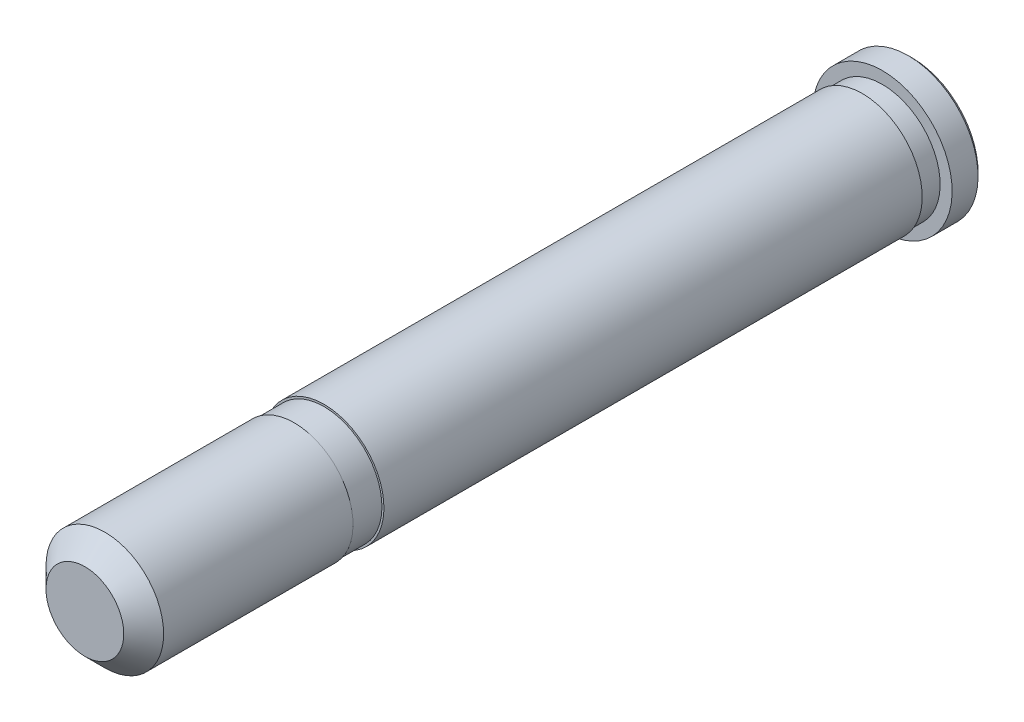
ISO-10303-21;
HEADER;
FILE_DESCRIPTION(('STEP AP214'),'2;1');
FILE_NAME('part.step','',(''),(''),'','','');
FILE_SCHEMA(('AUTOMOTIVE_DESIGN { 1 0 10303 214 1 1 1 1 }'));
ENDSEC;
DATA;
#1=APPLICATION_CONTEXT('core data for automotive mechanical design processes');
#2=APPLICATION_PROTOCOL_DEFINITION('international standard','automotive_design',2000,#1);
#3=PRODUCT_CONTEXT('',#1,'mechanical');
#4=PRODUCT('Part','Part','',(#3));
#5=PRODUCT_RELATED_PRODUCT_CATEGORY('part','',(#4));
#6=PRODUCT_DEFINITION_FORMATION('','',#4);
#7=PRODUCT_DEFINITION_CONTEXT('part definition',#1,'design');
#8=PRODUCT_DEFINITION('design','',#6,#7);
#9=PRODUCT_DEFINITION_SHAPE('','',#8);
#10=(LENGTH_UNIT() NAMED_UNIT(*) SI_UNIT(.MILLI.,.METRE.));
#11=(NAMED_UNIT(*) PLANE_ANGLE_UNIT() SI_UNIT($,.RADIAN.));
#12=(NAMED_UNIT(*) SI_UNIT($,.STERADIAN.) SOLID_ANGLE_UNIT());
#13=UNCERTAINTY_MEASURE_WITH_UNIT(LENGTH_MEASURE(1.E-05),#10,'distance_accuracy_value','');
#14=(GEOMETRIC_REPRESENTATION_CONTEXT(3) GLOBAL_UNCERTAINTY_ASSIGNED_CONTEXT((#13)) GLOBAL_UNIT_ASSIGNED_CONTEXT((#10,
#11,#12)) REPRESENTATION_CONTEXT('',''));
#15=CARTESIAN_POINT('',(0.,0.,0.));
#16=DIRECTION('',(0.,0.,1.));
#17=DIRECTION('',(1.,0.,0.));
#18=AXIS2_PLACEMENT_3D('',#15,#16,#17);
#19=CARTESIAN_POINT('',(3.,0.,1.5));
#20=DIRECTION('',(0.,0.,1.));
#21=DIRECTION('',(0.,-1.,0.));
#22=AXIS2_PLACEMENT_3D('',#19,#20,#21);
#23=PLANE('',#22);
#24=CARTESIAN_POINT('',(0.,0.,1.5));
#25=DIRECTION('',(0.,0.,-1.));
#26=DIRECTION('',(0.,1.,0.));
#27=AXIS2_PLACEMENT_3D('',#24,#25,#26);
#28=CIRCLE('',#27,3.5);
#29=CARTESIAN_POINT('',(0.,3.5,1.5));
#30=VERTEX_POINT('',#29);
#31=EDGE_CURVE('E37',#30,#30,#28,.T.);
#32=ORIENTED_EDGE('',*,*,#31,.F.);
#33=EDGE_LOOP('',(#32));
#34=FACE_BOUND('',#33,.T.);
#35=CARTESIAN_POINT('',(0.,0.,1.5));
#36=DIRECTION('',(0.,0.,-1.));
#37=DIRECTION('',(0.,1.,0.));
#38=AXIS2_PLACEMENT_3D('',#35,#36,#37);
#39=CIRCLE('',#38,2.9);
#40=CARTESIAN_POINT('',(0.,2.9,1.5));
#41=VERTEX_POINT('',#40);
#42=EDGE_CURVE('E32',#41,#41,#39,.T.);
#43=ORIENTED_EDGE('',*,*,#42,.T.);
#44=EDGE_LOOP('',(#43));
#45=FACE_BOUND('',#44,.T.);
#46=ADVANCED_FACE('F12',(#34,#45),#23,.T.);
#47=CARTESIAN_POINT('',(0.,0.,0.));
#48=DIRECTION('',(0.,0.,-1.));
#49=DIRECTION('',(0.,1.,0.));
#50=AXIS2_PLACEMENT_3D('',#47,#48,#49);
#51=CYLINDRICAL_SURFACE('',#50,3.5);
#52=CARTESIAN_POINT('',(0.,0.,0.200000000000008));
#53=DIRECTION('',(0.,0.,-1.));
#54=DIRECTION('',(0.,1.,0.));
#55=AXIS2_PLACEMENT_3D('',#52,#53,#54);
#56=CIRCLE('',#55,3.5);
#57=CARTESIAN_POINT('',(0.,3.5,0.200000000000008));
#58=VERTEX_POINT('',#57);
#59=EDGE_CURVE('E23',#58,#58,#56,.F.);
#60=ORIENTED_EDGE('',*,*,#59,.T.);
#61=EDGE_LOOP('',(#60));
#62=FACE_BOUND('',#61,.T.);
#63=ORIENTED_EDGE('',*,*,#31,.T.);
#64=EDGE_LOOP('',(#63));
#65=FACE_BOUND('',#64,.T.);
#66=ADVANCED_FACE('F86',(#62,#65),#51,.T.);
#67=CARTESIAN_POINT('',(0.,0.,0.));
#68=DIRECTION('',(0.,0.,-1.));
#69=DIRECTION('',(0.,1.,0.));
#70=AXIS2_PLACEMENT_3D('',#67,#68,#69);
#71=PLANE('',#70);
#72=CARTESIAN_POINT('',(0.,0.,0.));
#73=DIRECTION('',(0.,0.,-1.));
#74=DIRECTION('',(0.,1.,0.));
#75=AXIS2_PLACEMENT_3D('',#72,#73,#74);
#76=CIRCLE('',#75,3.3);
#77=CARTESIAN_POINT('',(0.,3.3,0.));
#78=VERTEX_POINT('',#77);
#79=EDGE_CURVE('E27',#78,#78,#76,.T.);
#80=ORIENTED_EDGE('',*,*,#79,.T.);
#81=EDGE_LOOP('',(#80));
#82=FACE_BOUND('',#81,.T.);
#83=ADVANCED_FACE('F93',(#82),#71,.T.);
#84=CARTESIAN_POINT('',(0.,0.,0.));
#85=DIRECTION('',(0.,0.,1.));
#86=DIRECTION('',(0.,-1.,0.));
#87=AXIS2_PLACEMENT_3D('',#84,#85,#86);
#88=CONICAL_SURFACE('',#87,3.3,0.785398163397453);
#89=ORIENTED_EDGE('',*,*,#59,.F.);
#90=EDGE_LOOP('',(#89));
#91=FACE_BOUND('',#90,.T.);
#92=ORIENTED_EDGE('',*,*,#79,.F.);
#93=EDGE_LOOP('',(#92));
#94=FACE_BOUND('',#93,.T.);
#95=ADVANCED_FACE('F102',(#91,#94),#88,.T.);
#96=CARTESIAN_POINT('',(3.,0.,2.5));
#97=DIRECTION('',(0.,0.,1.));
#98=DIRECTION('',(0.,-1.,0.));
#99=AXIS2_PLACEMENT_3D('',#96,#97,#98);
#100=PLANE('',#99);
#101=CARTESIAN_POINT('',(0.,0.,2.5));
#102=DIRECTION('',(0.,0.,-1.));
#103=DIRECTION('',(0.,1.,0.));
#104=AXIS2_PLACEMENT_3D('',#101,#102,#103);
#105=CIRCLE('',#104,2.9);
#106=CARTESIAN_POINT('',(0.,2.9,2.5));
#107=VERTEX_POINT('',#106);
#108=EDGE_CURVE('E43',#107,#107,#105,.T.);
#109=ORIENTED_EDGE('',*,*,#108,.F.);
#110=EDGE_LOOP('',(#109));
#111=FACE_BOUND('',#110,.T.);
#112=CARTESIAN_POINT('',(0.,0.,2.5));
#113=DIRECTION('',(0.,0.,-1.));
#114=DIRECTION('',(0.,1.,0.));
#115=AXIS2_PLACEMENT_3D('',#112,#113,#114);
#116=CIRCLE('',#115,3.);
#117=CARTESIAN_POINT('',(0.,3.,2.5));
#118=VERTEX_POINT('',#117);
#119=EDGE_CURVE('E40',#118,#118,#116,.T.);
#120=ORIENTED_EDGE('',*,*,#119,.T.);
#121=EDGE_LOOP('',(#120));
#122=FACE_BOUND('',#121,.T.);
#123=ADVANCED_FACE('F109',(#111,#122),#100,.F.);
#124=CARTESIAN_POINT('',(0.,0.,0.));
#125=DIRECTION('',(0.,0.,-1.));
#126=DIRECTION('',(0.,1.,0.));
#127=AXIS2_PLACEMENT_3D('',#124,#125,#126);
#128=CYLINDRICAL_SURFACE('',#127,2.9);
#129=ORIENTED_EDGE('',*,*,#42,.F.);
#130=EDGE_LOOP('',(#129));
#131=FACE_BOUND('',#130,.T.);
#132=ORIENTED_EDGE('',*,*,#108,.T.);
#133=EDGE_LOOP('',(#132));
#134=FACE_BOUND('',#133,.T.);
#135=ADVANCED_FACE('F106',(#131,#134),#128,.T.);
#136=CARTESIAN_POINT('',(0.,0.,0.));
#137=DIRECTION('',(0.,0.,-1.));
#138=DIRECTION('',(0.,1.,0.));
#139=AXIS2_PLACEMENT_3D('',#136,#137,#138);
#140=CYLINDRICAL_SURFACE('',#139,3.);
#141=CARTESIAN_POINT('',(0.,0.,29.5));
#142=DIRECTION('',(0.,0.,-1.));
#143=DIRECTION('',(0.,1.,0.));
#144=AXIS2_PLACEMENT_3D('',#141,#142,#143);
#145=CIRCLE('',#144,3.);
#146=CARTESIAN_POINT('',(0.,3.,29.5));
#147=VERTEX_POINT('',#146);
#148=EDGE_CURVE('E30',#147,#147,#145,.F.);
#149=ORIENTED_EDGE('',*,*,#148,.F.);
#150=EDGE_LOOP('',(#149));
#151=FACE_BOUND('',#150,.T.);
#152=ORIENTED_EDGE('',*,*,#119,.F.);
#153=EDGE_LOOP('',(#152));
#154=FACE_BOUND('',#153,.T.);
#155=ADVANCED_FACE('F104',(#151,#154),#140,.T.);
#156=CARTESIAN_POINT('',(2.95,0.,29.5));
#157=DIRECTION('',(0.,0.,-1.));
#158=DIRECTION('',(0.,1.,0.));
#159=AXIS2_PLACEMENT_3D('',#156,#157,#158);
#160=PLANE('',#159);
#161=ORIENTED_EDGE('',*,*,#148,.T.);
#162=EDGE_LOOP('',(#161));
#163=FACE_BOUND('',#162,.T.);
#164=CARTESIAN_POINT('',(0.,0.,29.5));
#165=DIRECTION('',(0.,0.,-1.));
#166=DIRECTION('',(0.,1.,0.));
#167=AXIS2_PLACEMENT_3D('',#164,#165,#166);
#168=CIRCLE('',#167,2.9);
#169=CARTESIAN_POINT('',(0.,2.9,29.5));
#170=VERTEX_POINT('',#169);
#171=EDGE_CURVE('E53',#170,#170,#168,.T.);
#172=ORIENTED_EDGE('',*,*,#171,.T.);
#173=EDGE_LOOP('',(#172));
#174=FACE_BOUND('',#173,.T.);
#175=ADVANCED_FACE('F57',(#163,#174),#160,.F.);
#176=CARTESIAN_POINT('',(2.95,0.,31.));
#177=DIRECTION('',(0.,0.,1.));
#178=DIRECTION('',(0.,-1.,0.));
#179=AXIS2_PLACEMENT_3D('',#176,#177,#178);
#180=PLANE('',#179);
#181=CARTESIAN_POINT('',(0.,0.,31.));
#182=DIRECTION('',(0.,0.,-1.));
#183=DIRECTION('',(0.,1.,0.));
#184=AXIS2_PLACEMENT_3D('',#181,#182,#183);
#185=CIRCLE('',#184,2.9);
#186=CARTESIAN_POINT('',(0.,2.9,31.));
#187=VERTEX_POINT('',#186);
#188=EDGE_CURVE('E50',#187,#187,#185,.T.);
#189=ORIENTED_EDGE('',*,*,#188,.F.);
#190=EDGE_LOOP('',(#189));
#191=FACE_BOUND('',#190,.T.);
#192=CARTESIAN_POINT('',(0.,0.,31.));
#193=DIRECTION('',(0.,0.,-1.));
#194=DIRECTION('',(0.,1.,0.));
#195=AXIS2_PLACEMENT_3D('',#192,#193,#194);
#196=CIRCLE('',#195,2.95);
#197=CARTESIAN_POINT('',(0.,2.95,31.));
#198=VERTEX_POINT('',#197);
#199=EDGE_CURVE('E33',#198,#198,#196,.T.);
#200=ORIENTED_EDGE('',*,*,#199,.T.);
#201=EDGE_LOOP('',(#200));
#202=FACE_BOUND('',#201,.T.);
#203=ADVANCED_FACE('F63',(#191,#202),#180,.F.);
#204=CARTESIAN_POINT('',(0.,0.,0.));
#205=DIRECTION('',(0.,0.,-1.));
#206=DIRECTION('',(0.,1.,0.));
#207=AXIS2_PLACEMENT_3D('',#204,#205,#206);
#208=CYLINDRICAL_SURFACE('',#207,2.9);
#209=ORIENTED_EDGE('',*,*,#171,.F.);
#210=EDGE_LOOP('',(#209));
#211=FACE_BOUND('',#210,.T.);
#212=ORIENTED_EDGE('',*,*,#188,.T.);
#213=EDGE_LOOP('',(#212));
#214=FACE_BOUND('',#213,.T.);
#215=ADVANCED_FACE('F59',(#211,#214),#208,.T.);
#216=CARTESIAN_POINT('',(0.,0.,41.5));
#217=DIRECTION('',(0.,0.,1.));
#218=DIRECTION('',(0.,-1.,0.));
#219=AXIS2_PLACEMENT_3D('',#216,#217,#218);
#220=PLANE('',#219);
#221=CARTESIAN_POINT('',(0.,0.,41.5));
#222=DIRECTION('',(0.,0.,1.));
#223=DIRECTION('',(0.,-1.,0.));
#224=AXIS2_PLACEMENT_3D('',#221,#222,#223);
#225=CIRCLE('',#224,1.95);
#226=CARTESIAN_POINT('',(0.,-1.95,41.5));
#227=VERTEX_POINT('',#226);
#228=EDGE_CURVE('E8',#227,#227,#225,.T.);
#229=ORIENTED_EDGE('',*,*,#228,.T.);
#230=EDGE_LOOP('',(#229));
#231=FACE_BOUND('',#230,.T.);
#232=ADVANCED_FACE('F62',(#231),#220,.T.);
#233=CARTESIAN_POINT('',(0.,0.,0.));
#234=DIRECTION('',(0.,0.,-1.));
#235=DIRECTION('',(0.,1.,0.));
#236=AXIS2_PLACEMENT_3D('',#233,#234,#235);
#237=CYLINDRICAL_SURFACE('',#236,2.95);
#238=CARTESIAN_POINT('',(0.,0.,40.5));
#239=DIRECTION('',(0.,0.,1.));
#240=DIRECTION('',(0.,-1.,0.));
#241=AXIS2_PLACEMENT_3D('',#238,#239,#240);
#242=CIRCLE('',#241,2.95);
#243=CARTESIAN_POINT('',(0.,-2.95,40.5));
#244=VERTEX_POINT('',#243);
#245=EDGE_CURVE('E19',#244,#244,#242,.F.);
#246=ORIENTED_EDGE('',*,*,#245,.T.);
#247=EDGE_LOOP('',(#246));
#248=FACE_BOUND('',#247,.T.);
#249=ORIENTED_EDGE('',*,*,#199,.F.);
#250=EDGE_LOOP('',(#249));
#251=FACE_BOUND('',#250,.T.);
#252=ADVANCED_FACE('F72',(#248,#251),#237,.T.);
#253=CARTESIAN_POINT('',(0.,0.,40.5));
#254=DIRECTION('',(0.,0.,-1.));
#255=DIRECTION('',(0.,1.,0.));
#256=AXIS2_PLACEMENT_3D('',#253,#254,#255);
#257=CONICAL_SURFACE('',#256,2.95,0.785398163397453);
#258=ORIENTED_EDGE('',*,*,#228,.F.);
#259=EDGE_LOOP('',(#258));
#260=FACE_BOUND('',#259,.T.);
#261=ORIENTED_EDGE('',*,*,#245,.F.);
#262=EDGE_LOOP('',(#261));
#263=FACE_BOUND('',#262,.T.);
#264=ADVANCED_FACE('F14',(#260,#263),#257,.T.);
#265=CLOSED_SHELL('',(#46,#66,#83,#95,#123,#135,#155,#175,#203,#215,#232,#252,#264));
#266=MANIFOLD_SOLID_BREP('B1',#265);
#267=ADVANCED_BREP_SHAPE_REPRESENTATION('',(#18,#266),#14);
#268=SHAPE_DEFINITION_REPRESENTATION(#9,#267);
ENDSEC;
END-ISO-10303-21;
